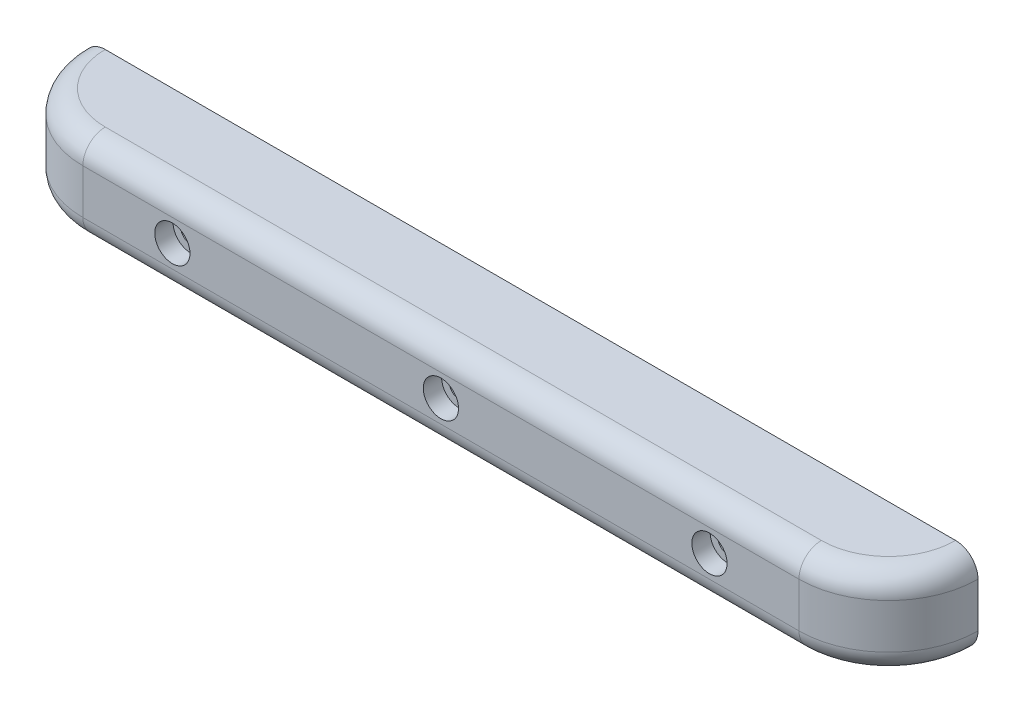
from build123d import *

# Parameters (mm, degrees)
SKETCH1_W                      = 254
SKETCH1_H                      = 25.4
EXTRUDE1_DEPTH                 = 25.4
CUT_EXTRUDE2_DEPTH             = 132.982271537
FILLET1_R                      = 6.35
CBORE_FOR_M5_SHCS1_D           = 5.7
CBORE_FOR_M5_SHCS1_CBORE_D     = 10
CBORE_FOR_M5_SHCS1_CBORE_DEPTH = 5.2


with BuildPart() as part:
    # Sketch1 → Extrude1 (new body)
    with BuildSketch(Plane.XY):
        Rectangle(SKETCH1_W, SKETCH1_H)
    extrude(amount=EXTRUDE1_DEPTH)

    # Sketch4 → Cut-Extrude2 (cut, through all)
    with BuildSketch(Plane(origin=(0, 12.7, 0), x_dir=(-1, 0, 0), z_dir=(0, 1, 0))):
        with BuildLine():
            Line((-127, 0), (-127, 25.4))
            Line((-127, 25.4), (-101.6, 25.4))
            ThreePointArc((-101.6, 25.4), (-119.560512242, 17.960512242), (-127, 0))
        make_face()
    cut_extrude2 = extrude(amount=-CUT_EXTRUDE2_DEPTH, mode=Mode.SUBTRACT)

    # Mirror1: Cut-Extrude2 across plane
    add(cut_extrude2.mirror(Plane(origin=(0, 0, 0), x_dir=(0, 0, 1), z_dir=(1, 0, 0))), mode=Mode.SUBTRACT)

    # Fillet1
    fillet1_edges = [part.edges().sort_by_distance(p)[0] for p in [
        (-101.6, 0, 25.4),
        (101.6, 0, 25.4),
        (0, -12.7, 25.4),
        (0, 12.7, 25.4),
        (-119.560512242, 12.7, 17.960512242),
        (119.560512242, 12.7, 17.960512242),
        (-119.560512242, -12.7, 17.960512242),
        (119.560512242, -12.7, 17.960512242),
    ]]
    fillet(fillet1_edges, radius=FILLET1_R)

    # CBORE for M5 SHCS1 (through all)
    with Locations(Plane.XY.offset(25.4)):
        with Locations((76.2, 0), (0, 0), (-76.2, 0)):
            CounterBoreHole(CBORE_FOR_M5_SHCS1_D / 2, CBORE_FOR_M5_SHCS1_CBORE_D / 2, CBORE_FOR_M5_SHCS1_CBORE_DEPTH)


solid = part.part
